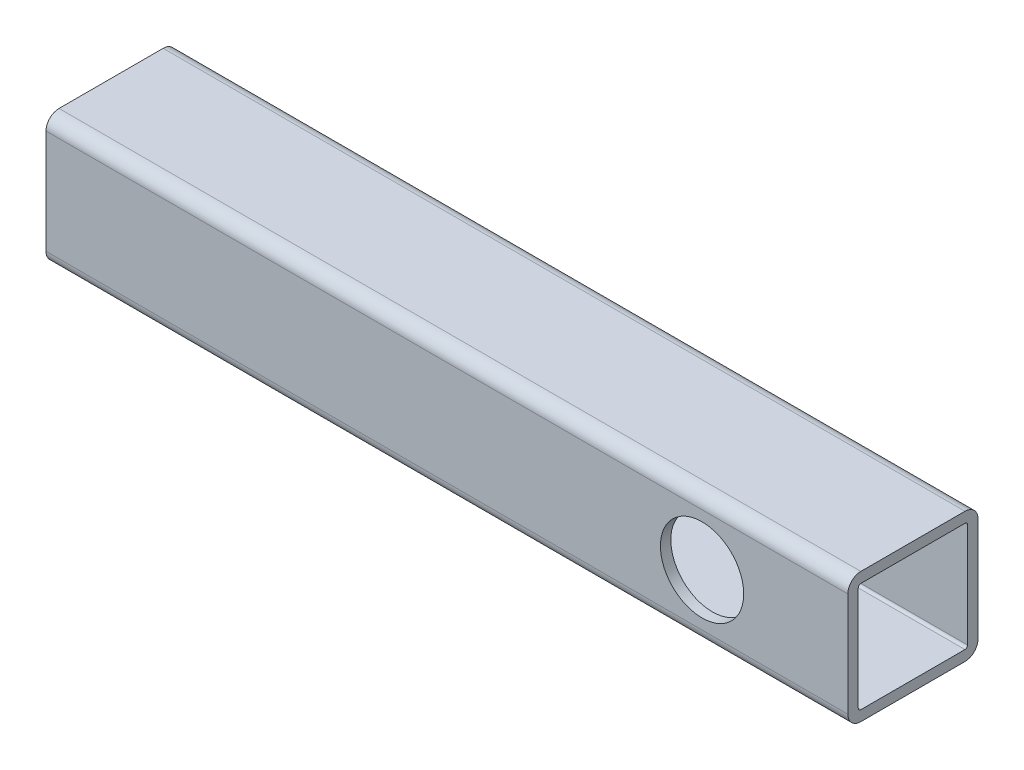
from build123d import *

# Parameters (mm, degrees)
BOSS_EXTRU_1_DEPTH      = 154
ESQUISSE2_R             = 8
ENL_V_MAT_EXTRU_1_DEPTH = 157.515973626


with BuildPart() as part:
    # Esquisse1 → Boss.-Extru.1 (new body)
    with BuildSketch(Plane(origin=(0, 0, 0), x_dir=(0, 0, -1), z_dir=(1, 0, 0))):
        with BuildLine():
            Line((-10, 12.5), (10, 12.5))
            ThreePointArc((10, 12.5), (11.767766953, 11.767766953), (12.5, 10))
            Line((12.5, 10), (12.5, -10))
            ThreePointArc((12.5, -10), (11.767766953, -11.767766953), (10, -12.5))
            Line((10, -12.5), (-10, -12.5))
            ThreePointArc((-10, -12.5), (-11.767766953, -11.767766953), (-12.5, -10))
            Line((-12.5, -10), (-12.5, 10))
            ThreePointArc((-12.5, 10), (-11.767766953, 11.767766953), (-10, 12.5))
        make_face()
        with BuildLine():
            Line((-10, 10.5), (10, 10.5))
            ThreePointArc((10, 10.5), (10.353553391, 10.353553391), (10.5, 10))
            Line((10.5, 10), (10.5, -10))
            ThreePointArc((10.5, -10), (10.353553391, -10.353553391), (10, -10.5))
            Line((10, -10.5), (-10, -10.5))
            ThreePointArc((-10, -10.5), (-10.353553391, -10.353553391), (-10.5, -10))
            Line((-10.5, -10), (-10.5, 10))
            ThreePointArc((-10.5, 10), (-10.353553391, 10.353553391), (-10, 10.5))
        make_face(mode=Mode.SUBTRACT)
    extrude(amount=BOSS_EXTRU_1_DEPTH)

    # Esquisse2 → Enl_v. mat.-Extru.1 (cut, through all)
    with BuildSketch(Plane.XY.offset(12.5)):
        with Locations((126, 0)):
            Circle(ESQUISSE2_R)
    extrude(amount=-ENL_V_MAT_EXTRU_1_DEPTH, mode=Mode.SUBTRACT)


solid = part.part
